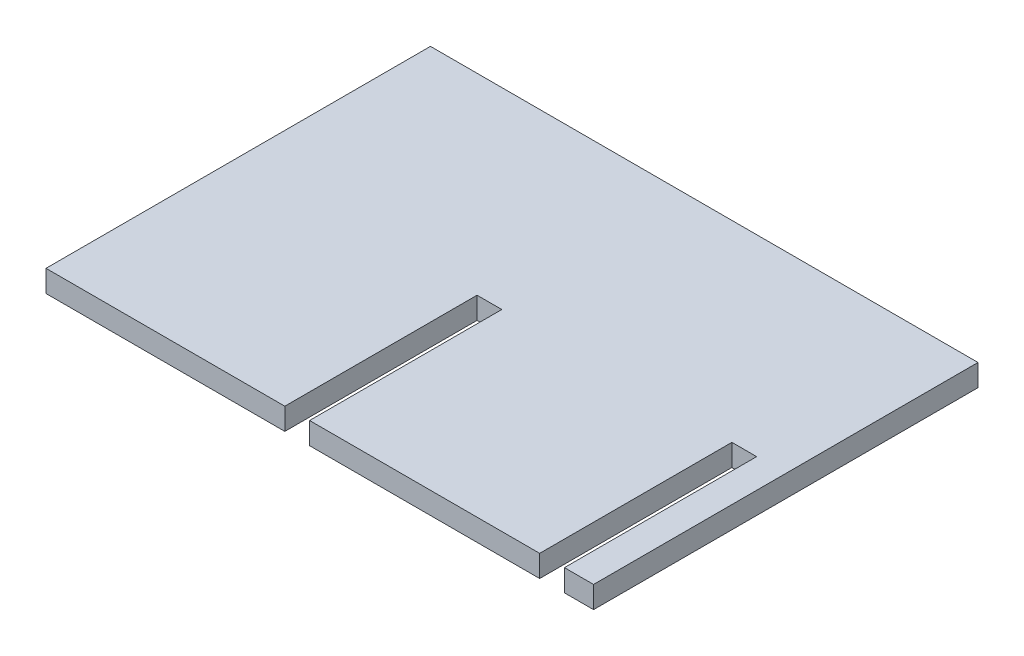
from build123d import *

# Parameters (mm, degrees)
CROQUIS14_W             = 69.5
CROQUIS14_H             = 1.5
SALIENTE_EXTRUIR8_DEPTH = 26.4
CROQUIS17_W             = 1.7
CROQUIS17_H             = 13.2
CORTAR_EXTRUIR1_DEPTH   = 1.5
CROQUIS18_W             = 31.9
CROQUIS18_H             = 26.4
CORTAR_EXTRUIR2_DEPTH   = 1.5


with BuildPart() as part:
    # Croquis14 → Saliente-Extruir8 (new body)
    with BuildSketch(Plane.XY):
        with Locations((0, -20)):
            Rectangle(CROQUIS14_W, CROQUIS14_H)
    extrude(amount=SALIENTE_EXTRUIR8_DEPTH)

    # Croquis17 → Cortar-Extruir1 (cut)
    with BuildSketch(Plane.XZ.offset(20.75)):
        with Locations((-17.5, 19.8)):
            Rectangle(CROQUIS17_W, CROQUIS17_H)
        with Locations((17.5, 19.8)):
            Rectangle(CROQUIS17_W, CROQUIS17_H)
        with Locations((0, 19.8)):
            Rectangle(CROQUIS17_W, CROQUIS17_H)
    extrude(amount=-CORTAR_EXTRUIR1_DEPTH, mode=Mode.SUBTRACT)

    # Croquis18 → Cortar-Extruir2 (cut)
    with BuildSketch(Plane.XZ.offset(20.75)):
        with Locations((18.8, 13.2)):
            Rectangle(CROQUIS18_W, CROQUIS18_H)
    extrude(amount=-CORTAR_EXTRUIR2_DEPTH, mode=Mode.SUBTRACT)


solid = part.part
